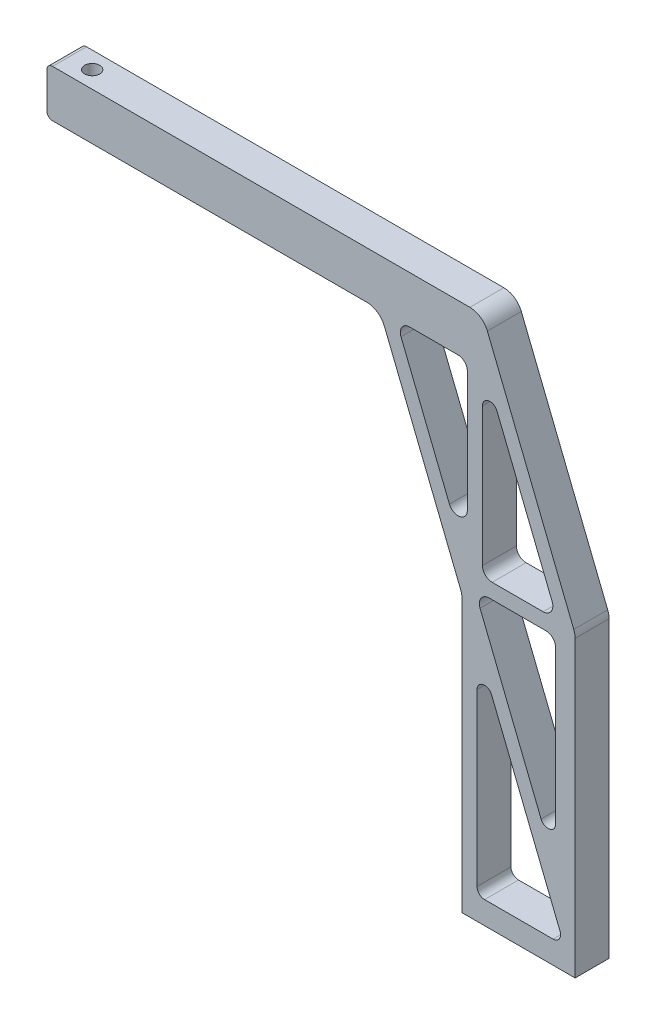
ISO-10303-21;
HEADER;
FILE_DESCRIPTION(('STEP AP214'),'2;1');
FILE_NAME('part.step','',(''),(''),'','','');
FILE_SCHEMA(('AUTOMOTIVE_DESIGN { 1 0 10303 214 1 1 1 1 }'));
ENDSEC;
DATA;
#1=APPLICATION_CONTEXT('core data for automotive mechanical design processes');
#2=APPLICATION_PROTOCOL_DEFINITION('international standard','automotive_design',2000,#1);
#3=PRODUCT_CONTEXT('',#1,'mechanical');
#4=PRODUCT('Part','Part','',(#3));
#5=PRODUCT_RELATED_PRODUCT_CATEGORY('part','',(#4));
#6=PRODUCT_DEFINITION_FORMATION('','',#4);
#7=PRODUCT_DEFINITION_CONTEXT('part definition',#1,'design');
#8=PRODUCT_DEFINITION('design','',#6,#7);
#9=PRODUCT_DEFINITION_SHAPE('','',#8);
#10=(LENGTH_UNIT() NAMED_UNIT(*) SI_UNIT(.MILLI.,.METRE.));
#11=(NAMED_UNIT(*) PLANE_ANGLE_UNIT() SI_UNIT($,.RADIAN.));
#12=(NAMED_UNIT(*) SI_UNIT($,.STERADIAN.) SOLID_ANGLE_UNIT());
#13=UNCERTAINTY_MEASURE_WITH_UNIT(LENGTH_MEASURE(1.E-05),#10,'distance_accuracy_value','');
#14=(GEOMETRIC_REPRESENTATION_CONTEXT(3) GLOBAL_UNCERTAINTY_ASSIGNED_CONTEXT((#13)) GLOBAL_UNIT_ASSIGNED_CONTEXT((#10,
#11,#12)) REPRESENTATION_CONTEXT('',''));
#15=CARTESIAN_POINT('',(0.,0.,0.));
#16=DIRECTION('',(0.,0.,1.));
#17=DIRECTION('',(1.,0.,0.));
#18=AXIS2_PLACEMENT_3D('',#15,#16,#17);
#19=CARTESIAN_POINT('',(50.,155.927840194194,18.));
#20=DIRECTION('',(0.,0.,1.));
#21=DIRECTION('',(1.,0.,0.));
#22=AXIS2_PLACEMENT_3D('',#19,#20,#21);
#23=PLANE('',#22);
#24=DIRECTION('',(0.,1.,0.));
#25=VECTOR('',#24,1.);
#26=CARTESIAN_POINT('',(49.6632497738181,65.4846192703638,18.));
#27=LINE('',#26,#25);
#28=CARTESIAN_POINT('',(49.6632497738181,65.4846192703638,18.));
#29=VERTEX_POINT('',#28);
#30=CARTESIAN_POINT('',(49.6632497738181,146.495883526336,18.));
#31=VERTEX_POINT('',#30);
#32=EDGE_CURVE('E352',#29,#31,#27,.T.);
#33=ORIENTED_EDGE('',*,*,#32,.F.);
#34=CARTESIAN_POINT('',(45.6632497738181,65.4846192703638,18.));
#35=DIRECTION('',(0.,0.,1.));
#36=DIRECTION('',(1.,0.,0.));
#37=AXIS2_PLACEMENT_3D('',#34,#35,#36);
#38=CIRCLE('',#37,4.);
#39=CARTESIAN_POINT('',(41.9512098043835,63.9943980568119,18.));
#40=VERTEX_POINT('',#39);
#41=EDGE_CURVE('E350',#40,#29,#38,.T.);
#42=ORIENTED_EDGE('',*,*,#41,.F.);
#43=DIRECTION('',(0.372555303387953,-0.928009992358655,0.));
#44=VECTOR('',#43,1.);
#45=CARTESIAN_POINT('',(9.60186337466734,144.574425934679,18.));
#46=LINE('',#45,#44);
#47=CARTESIAN_POINT('',(9.60186337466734,144.574425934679,18.));
#48=VERTEX_POINT('',#47);
#49=EDGE_CURVE('E365',#48,#40,#46,.T.);
#50=ORIENTED_EDGE('',*,*,#49,.F.);
#51=CARTESIAN_POINT('',(14.3880839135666,146.495883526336,18.));
#52=DIRECTION('',(0.,0.,1.));
#53=DIRECTION('',(1.,0.,0.));
#54=AXIS2_PLACEMENT_3D('',#51,#52,#53);
#55=CIRCLE('',#54,5.15750970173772);
#56=CARTESIAN_POINT('',(14.3880839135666,151.653393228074,18.));
#57=VERTEX_POINT('',#56);
#58=EDGE_CURVE('E362',#57,#48,#55,.T.);
#59=ORIENTED_EDGE('',*,*,#58,.F.);
#60=DIRECTION('',(-1.,0.,0.));
#61=VECTOR('',#60,1.);
#62=CARTESIAN_POINT('',(44.5057400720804,151.653393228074,18.));
#63=LINE('',#62,#61);
#64=CARTESIAN_POINT('',(44.5057400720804,151.653393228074,18.));
#65=VERTEX_POINT('',#64);
#66=EDGE_CURVE('E359',#65,#57,#63,.T.);
#67=ORIENTED_EDGE('',*,*,#66,.F.);
#68=CARTESIAN_POINT('',(44.5057400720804,146.495883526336,18.));
#69=DIRECTION('',(0.,0.,1.));
#70=DIRECTION('',(1.,0.,0.));
#71=AXIS2_PLACEMENT_3D('',#68,#69,#70);
#72=CIRCLE('',#71,5.15750970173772);
#73=EDGE_CURVE('E356',#31,#65,#72,.T.);
#74=ORIENTED_EDGE('',*,*,#73,.F.);
#75=EDGE_LOOP('',(#33,#42,#50,#59,#67,#74));
#76=FACE_BOUND('',#75,.T.);
#77=DIRECTION('',(1.,0.,0.));
#78=VECTOR('',#77,1.);
#79=CARTESIAN_POINT('',(48.2879600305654,12.,18.));
#80=LINE('',#79,#78);
#81=CARTESIAN_POINT('',(12.,12.,18.));
#82=VERTEX_POINT('',#81);
#83=CARTESIAN_POINT('',(48.2879600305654,12.,18.));
#84=VERTEX_POINT('',#83);
#85=EDGE_CURVE('E458',#82,#84,#80,.T.);
#86=ORIENTED_EDGE('',*,*,#85,.F.);
#87=CARTESIAN_POINT('',(12.,16.,18.));
#88=DIRECTION('',(0.,0.,1.));
#89=DIRECTION('',(1.,0.,0.));
#90=AXIS2_PLACEMENT_3D('',#87,#88,#89);
#91=CIRCLE('',#90,4.);
#92=CARTESIAN_POINT('',(8.00000000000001,16.,18.));
#93=VERTEX_POINT('',#92);
#94=EDGE_CURVE('E456',#93,#82,#91,.T.);
#95=ORIENTED_EDGE('',*,*,#94,.F.);
#96=DIRECTION('',(0.,-1.,0.));
#97=VECTOR('',#96,1.);
#98=CARTESIAN_POINT('',(8.00000000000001,16.,18.));
#99=LINE('',#98,#97);
#100=CARTESIAN_POINT('',(7.99999999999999,106.390847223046,18.));
#101=VERTEX_POINT('',#100);
#102=EDGE_CURVE('E468',#101,#93,#99,.T.);
#103=ORIENTED_EDGE('',*,*,#102,.F.);
#104=CARTESIAN_POINT('',(12.,106.390847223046,18.));
#105=DIRECTION('',(0.,0.,1.));
#106=DIRECTION('',(-1.,0.,0.));
#107=AXIS2_PLACEMENT_3D('',#104,#105,#106);
#108=CIRCLE('',#107,4.);
#109=CARTESIAN_POINT('',(15.7120399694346,107.881068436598,18.));
#110=VERTEX_POINT('',#109);
#111=EDGE_CURVE('E465',#110,#101,#108,.T.);
#112=ORIENTED_EDGE('',*,*,#111,.F.);
#113=DIRECTION('',(-0.372555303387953,0.928009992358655,0.));
#114=VECTOR('',#113,1.);
#115=CARTESIAN_POINT('',(15.7120399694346,107.881068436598,18.));
#116=LINE('',#115,#114);
#117=CARTESIAN_POINT('',(52.,17.4902212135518,18.));
#118=VERTEX_POINT('',#117);
#119=EDGE_CURVE('E463',#118,#110,#116,.T.);
#120=ORIENTED_EDGE('',*,*,#119,.F.);
#121=CARTESIAN_POINT('',(48.2879600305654,16.,18.));
#122=DIRECTION('',(0.,0.,1.));
#123=DIRECTION('',(-1.,0.,0.));
#124=AXIS2_PLACEMENT_3D('',#121,#122,#123);
#125=CIRCLE('',#124,4.);
#126=EDGE_CURVE('E461',#84,#118,#125,.T.);
#127=ORIENTED_EDGE('',*,*,#126,.F.);
#128=EDGE_LOOP('',(#86,#95,#103,#112,#120,#127));
#129=FACE_BOUND('',#128,.T.);
#130=DIRECTION('',(0.,-1.,0.));
#131=VECTOR('',#130,1.);
#132=CARTESIAN_POINT('',(0.,100.736428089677,18.));
#133=LINE('',#132,#131);
#134=CARTESIAN_POINT('',(0.,144.333855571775,18.));
#135=VERTEX_POINT('',#134);
#136=CARTESIAN_POINT('',(0.,0.,18.));
#137=VERTEX_POINT('',#136);
#138=EDGE_CURVE('E501',#135,#137,#133,.T.);
#139=ORIENTED_EDGE('',*,*,#138,.T.);
#140=DIRECTION('',(1.,0.,0.));
#141=VECTOR('',#140,1.);
#142=CARTESIAN_POINT('',(0.,0.,18.));
#143=LINE('',#142,#141);
#144=CARTESIAN_POINT('',(60.,0.,18.));
#145=VERTEX_POINT('',#144);
#146=EDGE_CURVE('E504',#137,#145,#143,.T.);
#147=ORIENTED_EDGE('',*,*,#146,.T.);
#148=DIRECTION('',(0.,1.,0.));
#149=VECTOR('',#148,1.);
#150=CARTESIAN_POINT('',(60.,0.,18.));
#151=LINE('',#150,#149);
#152=CARTESIAN_POINT('',(60.,155.927840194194,18.));
#153=VERTEX_POINT('',#152);
#154=EDGE_CURVE('E507',#145,#153,#151,.T.);
#155=ORIENTED_EDGE('',*,*,#154,.T.);
#156=CARTESIAN_POINT('',(50.,155.927840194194,18.));
#157=DIRECTION('',(0.,0.,1.));
#158=DIRECTION('',(1.,0.,0.));
#159=AXIS2_PLACEMENT_3D('',#156,#157,#158);
#160=CIRCLE('',#159,9.99999999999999);
#161=CARTESIAN_POINT('',(59.2800999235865,159.653393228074,18.));
#162=VERTEX_POINT('',#161);
#163=EDGE_CURVE('E510',#153,#162,#160,.T.);
#164=ORIENTED_EDGE('',*,*,#163,.T.);
#165=DIRECTION('',(-0.372555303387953,0.928009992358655,0.));
#166=VECTOR('',#165,1.);
#167=CARTESIAN_POINT('',(13.4851317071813,273.72555303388,18.));
#168=LINE('',#167,#166);
#169=CARTESIAN_POINT('',(13.4851317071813,273.72555303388,18.));
#170=VERTEX_POINT('',#169);
#171=EDGE_CURVE('E513',#162,#170,#168,.T.);
#172=ORIENTED_EDGE('',*,*,#171,.T.);
#173=CARTESIAN_POINT('',(4.20503178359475,270.,18.));
#174=DIRECTION('',(0.,0.,1.));
#175=DIRECTION('',(-1.,0.,0.));
#176=AXIS2_PLACEMENT_3D('',#173,#174,#175);
#177=CIRCLE('',#176,9.99999999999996);
#178=CARTESIAN_POINT('',(4.20503178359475,280.,18.));
#179=VERTEX_POINT('',#178);
#180=EDGE_CURVE('E516',#170,#179,#177,.T.);
#181=ORIENTED_EDGE('',*,*,#180,.T.);
#182=DIRECTION('',(-1.,0.,0.));
#183=VECTOR('',#182,1.);
#184=CARTESIAN_POINT('',(4.20503178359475,280.,18.));
#185=LINE('',#184,#183);
#186=CARTESIAN_POINT('',(-217.,280.,18.));
#187=VERTEX_POINT('',#186);
#188=EDGE_CURVE('E518',#179,#187,#185,.T.);
#189=ORIENTED_EDGE('',*,*,#188,.T.);
#190=CARTESIAN_POINT('',(-217.,277.,18.));
#191=DIRECTION('',(0.,0.,1.));
#192=DIRECTION('',(1.,0.,0.));
#193=AXIS2_PLACEMENT_3D('',#190,#191,#192);
#194=CIRCLE('',#193,3.);
#195=CARTESIAN_POINT('',(-220.,277.,18.));
#196=VERTEX_POINT('',#195);
#197=EDGE_CURVE('E520',#187,#196,#194,.T.);
#198=ORIENTED_EDGE('',*,*,#197,.T.);
#199=DIRECTION('',(0.,-1.,0.));
#200=VECTOR('',#199,1.);
#201=CARTESIAN_POINT('',(-220.,277.,18.));
#202=LINE('',#201,#200);
#203=CARTESIAN_POINT('',(-220.,258.,18.));
#204=VERTEX_POINT('',#203);
#205=EDGE_CURVE('E522',#196,#204,#202,.T.);
#206=ORIENTED_EDGE('',*,*,#205,.T.);
#207=CARTESIAN_POINT('',(-217.,258.,18.));
#208=DIRECTION('',(0.,0.,1.));
#209=DIRECTION('',(1.,0.,0.));
#210=AXIS2_PLACEMENT_3D('',#207,#208,#209);
#211=CIRCLE('',#210,3.);
#212=CARTESIAN_POINT('',(-217.,255.,18.));
#213=VERTEX_POINT('',#212);
#214=EDGE_CURVE('E524',#204,#213,#211,.T.);
#215=ORIENTED_EDGE('',*,*,#214,.T.);
#216=DIRECTION('',(1.,0.,0.));
#217=VECTOR('',#216,1.);
#218=CARTESIAN_POINT('',(-217.,255.,18.));
#219=LINE('',#218,#217);
#220=CARTESIAN_POINT('',(-50.4130411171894,255.,18.));
#221=VERTEX_POINT('',#220);
#222=EDGE_CURVE('E526',#213,#221,#219,.T.);
#223=ORIENTED_EDGE('',*,*,#222,.T.);
#224=CARTESIAN_POINT('',(-50.4130411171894,245.,18.));
#225=DIRECTION('',(0.,0.,-1.));
#226=DIRECTION('',(-1.,0.,0.));
#227=AXIS2_PLACEMENT_3D('',#224,#225,#226);
#228=CIRCLE('',#227,10.);
#229=CARTESIAN_POINT('',(-41.1329411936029,248.725553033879,18.));
#230=VERTEX_POINT('',#229);
#231=EDGE_CURVE('E528',#221,#230,#228,.T.);
#232=ORIENTED_EDGE('',*,*,#231,.T.);
#233=DIRECTION('',(0.372555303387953,-0.928009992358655,0.));
#234=VECTOR('',#233,1.);
#235=CARTESIAN_POINT('',(-41.1329411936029,248.725553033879,18.));
#236=LINE('',#235,#234);
#237=CARTESIAN_POINT('',(-0.719900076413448,148.059408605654,18.));
#238=VERTEX_POINT('',#237);
#239=EDGE_CURVE('E530',#230,#238,#236,.T.);
#240=ORIENTED_EDGE('',*,*,#239,.T.);
#241=CARTESIAN_POINT('',(-10.,144.333855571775,18.));
#242=DIRECTION('',(0.,0.,-1.));
#243=DIRECTION('',(1.,0.,0.));
#244=AXIS2_PLACEMENT_3D('',#241,#242,#243);
#245=CIRCLE('',#244,10.);
#246=EDGE_CURVE('E532',#238,#135,#245,.T.);
#247=ORIENTED_EDGE('',*,*,#246,.T.);
#248=EDGE_LOOP('',(#139,#147,#155,#164,#172,#181,#189,#198,#206,#215,#223,#232,#240,#247));
#249=FACE_BOUND('',#248,.T.);
#250=DIRECTION('',(0.,-1.,0.));
#251=VECTOR('',#250,1.);
#252=CARTESIAN_POINT('',(10.8557423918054,238.101471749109,18.));
#253=LINE('',#252,#251);
#254=CARTESIAN_POINT('',(10.8557423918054,238.101471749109,18.));
#255=VERTEX_POINT('',#254);
#256=CARTESIAN_POINT('',(10.8557423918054,164.810902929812,18.));
#257=VERTEX_POINT('',#256);
#258=EDGE_CURVE('E405',#255,#257,#253,.T.);
#259=ORIENTED_EDGE('',*,*,#258,.F.);
#260=CARTESIAN_POINT('',(14.8557423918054,238.101471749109,18.));
#261=DIRECTION('',(0.,0.,1.));
#262=DIRECTION('',(-1.,0.,0.));
#263=AXIS2_PLACEMENT_3D('',#260,#261,#262);
#264=CIRCLE('',#263,4.);
#265=CARTESIAN_POINT('',(18.5677823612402,239.591692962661,18.));
#266=VERTEX_POINT('',#265);
#267=EDGE_CURVE('E403',#266,#255,#264,.T.);
#268=ORIENTED_EDGE('',*,*,#267,.F.);
#269=DIRECTION('',(-0.372555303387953,0.928009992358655,0.));
#270=VECTOR('',#269,1.);
#271=CARTESIAN_POINT('',(47.8176082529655,166.732360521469,18.));
#272=LINE('',#271,#270);
#273=CARTESIAN_POINT('',(47.8176082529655,166.732360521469,18.));
#274=VERTEX_POINT('',#273);
#275=EDGE_CURVE('E417',#274,#266,#272,.T.);
#276=ORIENTED_EDGE('',*,*,#275,.F.);
#277=CARTESIAN_POINT('',(43.0313877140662,164.810902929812,18.));
#278=DIRECTION('',(0.,0.,1.));
#279=DIRECTION('',(1.,0.,0.));
#280=AXIS2_PLACEMENT_3D('',#277,#278,#279);
#281=CIRCLE('',#280,5.15750970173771);
#282=CARTESIAN_POINT('',(43.0313877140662,159.653393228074,18.));
#283=VERTEX_POINT('',#282);
#284=EDGE_CURVE('E413',#283,#274,#281,.T.);
#285=ORIENTED_EDGE('',*,*,#284,.F.);
#286=DIRECTION('',(1.,0.,0.));
#287=VECTOR('',#286,1.);
#288=CARTESIAN_POINT('',(16.0132520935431,159.653393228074,18.));
#289=LINE('',#288,#287);
#290=CARTESIAN_POINT('',(16.0132520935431,159.653393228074,18.));
#291=VERTEX_POINT('',#290);
#292=EDGE_CURVE('E410',#291,#283,#289,.T.);
#293=ORIENTED_EDGE('',*,*,#292,.F.);
#294=CARTESIAN_POINT('',(16.0132520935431,164.810902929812,18.));
#295=DIRECTION('',(0.,0.,1.));
#296=DIRECTION('',(1.,0.,0.));
#297=AXIS2_PLACEMENT_3D('',#294,#295,#296);
#298=CIRCLE('',#297,5.15750970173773);
#299=EDGE_CURVE('E408',#257,#291,#298,.T.);
#300=ORIENTED_EDGE('',*,*,#299,.F.);
#301=EDGE_LOOP('',(#259,#268,#276,#285,#293,#300));
#302=FACE_BOUND('',#301,.T.);
#303=DIRECTION('',(0.,1.,0.));
#304=VECTOR('',#303,1.);
#305=CARTESIAN_POINT('',(2.85574239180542,186.073407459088,18.));
#306=LINE('',#305,#304);
#307=CARTESIAN_POINT('',(2.85574239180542,186.073407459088,18.));
#308=VERTEX_POINT('',#307);
#309=CARTESIAN_POINT('',(2.85574239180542,250.082728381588,18.));
#310=VERTEX_POINT('',#309);
#311=EDGE_CURVE('E305',#308,#310,#306,.T.);
#312=ORIENTED_EDGE('',*,*,#311,.F.);
#313=CARTESIAN_POINT('',(-2.06152922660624,186.073407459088,18.));
#314=DIRECTION('',(0.,0.,1.));
#315=DIRECTION('',(-1.,0.,0.));
#316=AXIS2_PLACEMENT_3D('',#313,#314,#315);
#317=CIRCLE('',#316,4.91727161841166);
#318=CARTESIAN_POINT('',(-6.62480642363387,184.241451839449,18.));
#319=VERTEX_POINT('',#318);
#320=EDGE_CURVE('E297',#319,#308,#317,.T.);
#321=ORIENTED_EDGE('',*,*,#320,.F.);
#322=DIRECTION('',(0.372555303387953,-0.928009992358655,0.));
#323=VECTOR('',#322,1.);
#324=CARTESIAN_POINT('',(-32.321740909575,248.25077276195,18.));
#325=LINE('',#324,#323);
#326=CARTESIAN_POINT('',(-32.321740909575,248.25077276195,18.));
#327=VERTEX_POINT('',#326);
#328=EDGE_CURVE('E327',#327,#319,#325,.T.);
#329=ORIENTED_EDGE('',*,*,#328,.F.);
#330=CARTESIAN_POINT('',(-27.7584637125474,250.082728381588,18.));
#331=DIRECTION('',(0.,0.,1.));
#332=DIRECTION('',(1.,0.,0.));
#333=AXIS2_PLACEMENT_3D('',#330,#331,#332);
#334=CIRCLE('',#333,4.91727161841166);
#335=CARTESIAN_POINT('',(-27.7584637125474,255.,18.));
#336=VERTEX_POINT('',#335);
#337=EDGE_CURVE('E325',#336,#327,#334,.T.);
#338=ORIENTED_EDGE('',*,*,#337,.F.);
#339=DIRECTION('',(-1.,0.,0.));
#340=VECTOR('',#339,1.);
#341=CARTESIAN_POINT('',(-27.7584637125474,255.,18.));
#342=LINE('',#341,#340);
#343=CARTESIAN_POINT('',(-2.06152922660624,255.,18.));
#344=VERTEX_POINT('',#343);
#345=EDGE_CURVE('E320',#344,#336,#342,.T.);
#346=ORIENTED_EDGE('',*,*,#345,.F.);
#347=CARTESIAN_POINT('',(-2.06152922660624,250.082728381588,18.));
#348=DIRECTION('',(0.,0.,1.));
#349=DIRECTION('',(1.,0.,0.));
#350=AXIS2_PLACEMENT_3D('',#347,#348,#349);
#351=CIRCLE('',#350,4.91727161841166);
#352=EDGE_CURVE('E318',#310,#344,#351,.T.);
#353=ORIENTED_EDGE('',*,*,#352,.F.);
#354=EDGE_LOOP('',(#312,#321,#329,#338,#346,#353));
#355=FACE_BOUND('',#354,.T.);
#356=ADVANCED_FACE('F40',(#76,#129,#249,#302,#355),#23,.T.);
#357=CARTESIAN_POINT('',(50.,155.927840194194,0.));
#358=DIRECTION('',(0.,0.,1.));
#359=DIRECTION('',(1.,0.,0.));
#360=AXIS2_PLACEMENT_3D('',#357,#358,#359);
#361=PLANE('',#360);
#362=CARTESIAN_POINT('',(45.6632497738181,65.4846192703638,0.));
#363=DIRECTION('',(0.,0.,1.));
#364=DIRECTION('',(1.,0.,0.));
#365=AXIS2_PLACEMENT_3D('',#362,#363,#364);
#366=CIRCLE('',#365,4.);
#367=CARTESIAN_POINT('',(41.9512098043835,63.9943980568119,0.));
#368=VERTEX_POINT('',#367);
#369=CARTESIAN_POINT('',(49.6632497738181,65.4846192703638,0.));
#370=VERTEX_POINT('',#369);
#371=EDGE_CURVE('E313',#368,#370,#366,.T.);
#372=ORIENTED_EDGE('',*,*,#371,.T.);
#373=DIRECTION('',(0.,1.,0.));
#374=VECTOR('',#373,1.);
#375=CARTESIAN_POINT('',(49.6632497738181,65.4846192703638,0.));
#376=LINE('',#375,#374);
#377=CARTESIAN_POINT('',(49.6632497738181,146.495883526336,0.));
#378=VERTEX_POINT('',#377);
#379=EDGE_CURVE('E370',#370,#378,#376,.T.);
#380=ORIENTED_EDGE('',*,*,#379,.T.);
#381=CARTESIAN_POINT('',(44.5057400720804,146.495883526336,0.));
#382=DIRECTION('',(0.,0.,1.));
#383=DIRECTION('',(1.,0.,0.));
#384=AXIS2_PLACEMENT_3D('',#381,#382,#383);
#385=CIRCLE('',#384,5.15750970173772);
#386=CARTESIAN_POINT('',(44.5057400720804,151.653393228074,0.));
#387=VERTEX_POINT('',#386);
#388=EDGE_CURVE('E374',#378,#387,#385,.T.);
#389=ORIENTED_EDGE('',*,*,#388,.T.);
#390=DIRECTION('',(-1.,0.,0.));
#391=VECTOR('',#390,1.);
#392=CARTESIAN_POINT('',(44.5057400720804,151.653393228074,0.));
#393=LINE('',#392,#391);
#394=CARTESIAN_POINT('',(14.3880839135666,151.653393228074,0.));
#395=VERTEX_POINT('',#394);
#396=EDGE_CURVE('E378',#387,#395,#393,.T.);
#397=ORIENTED_EDGE('',*,*,#396,.T.);
#398=CARTESIAN_POINT('',(14.3880839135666,146.495883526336,0.));
#399=DIRECTION('',(0.,0.,1.));
#400=DIRECTION('',(1.,0.,0.));
#401=AXIS2_PLACEMENT_3D('',#398,#399,#400);
#402=CIRCLE('',#401,5.15750970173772);
#403=CARTESIAN_POINT('',(9.60186337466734,144.574425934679,0.));
#404=VERTEX_POINT('',#403);
#405=EDGE_CURVE('E382',#395,#404,#402,.T.);
#406=ORIENTED_EDGE('',*,*,#405,.T.);
#407=DIRECTION('',(0.372555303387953,-0.928009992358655,0.));
#408=VECTOR('',#407,1.);
#409=CARTESIAN_POINT('',(9.60186337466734,144.574425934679,0.));
#410=LINE('',#409,#408);
#411=EDGE_CURVE('E353',#404,#368,#410,.T.);
#412=ORIENTED_EDGE('',*,*,#411,.T.);
#413=EDGE_LOOP('',(#372,#380,#389,#397,#406,#412));
#414=FACE_BOUND('',#413,.T.);
#415=CARTESIAN_POINT('',(12.,16.,0.));
#416=DIRECTION('',(0.,0.,1.));
#417=DIRECTION('',(1.,0.,0.));
#418=AXIS2_PLACEMENT_3D('',#415,#416,#417);
#419=CIRCLE('',#418,4.);
#420=CARTESIAN_POINT('',(8.00000000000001,16.,0.));
#421=VERTEX_POINT('',#420);
#422=CARTESIAN_POINT('',(12.,12.,0.));
#423=VERTEX_POINT('',#422);
#424=EDGE_CURVE('E455',#421,#423,#419,.T.);
#425=ORIENTED_EDGE('',*,*,#424,.T.);
#426=DIRECTION('',(1.,0.,0.));
#427=VECTOR('',#426,1.);
#428=CARTESIAN_POINT('',(48.2879600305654,12.,0.));
#429=LINE('',#428,#427);
#430=CARTESIAN_POINT('',(48.2879600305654,12.,0.));
#431=VERTEX_POINT('',#430);
#432=EDGE_CURVE('E473',#423,#431,#429,.T.);
#433=ORIENTED_EDGE('',*,*,#432,.T.);
#434=CARTESIAN_POINT('',(48.2879600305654,16.,0.));
#435=DIRECTION('',(0.,0.,1.));
#436=DIRECTION('',(-1.,0.,0.));
#437=AXIS2_PLACEMENT_3D('',#434,#435,#436);
#438=CIRCLE('',#437,4.);
#439=CARTESIAN_POINT('',(52.,17.4902212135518,0.));
#440=VERTEX_POINT('',#439);
#441=EDGE_CURVE('E476',#431,#440,#438,.T.);
#442=ORIENTED_EDGE('',*,*,#441,.T.);
#443=DIRECTION('',(-0.372555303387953,0.928009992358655,0.));
#444=VECTOR('',#443,1.);
#445=CARTESIAN_POINT('',(15.7120399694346,107.881068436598,0.));
#446=LINE('',#445,#444);
#447=CARTESIAN_POINT('',(15.7120399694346,107.881068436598,0.));
#448=VERTEX_POINT('',#447);
#449=EDGE_CURVE('E479',#440,#448,#446,.T.);
#450=ORIENTED_EDGE('',*,*,#449,.T.);
#451=CARTESIAN_POINT('',(12.,106.390847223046,0.));
#452=DIRECTION('',(0.,0.,1.));
#453=DIRECTION('',(-1.,0.,0.));
#454=AXIS2_PLACEMENT_3D('',#451,#452,#453);
#455=CIRCLE('',#454,4.);
#456=CARTESIAN_POINT('',(7.99999999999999,106.390847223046,0.));
#457=VERTEX_POINT('',#456);
#458=EDGE_CURVE('E482',#448,#457,#455,.T.);
#459=ORIENTED_EDGE('',*,*,#458,.T.);
#460=DIRECTION('',(0.,-1.,0.));
#461=VECTOR('',#460,1.);
#462=CARTESIAN_POINT('',(8.00000000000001,16.,0.));
#463=LINE('',#462,#461);
#464=EDGE_CURVE('E459',#457,#421,#463,.T.);
#465=ORIENTED_EDGE('',*,*,#464,.T.);
#466=EDGE_LOOP('',(#425,#433,#442,#450,#459,#465));
#467=FACE_BOUND('',#466,.T.);
#468=DIRECTION('',(1.,0.,0.));
#469=VECTOR('',#468,1.);
#470=CARTESIAN_POINT('',(0.,0.,0.));
#471=LINE('',#470,#469);
#472=CARTESIAN_POINT('',(0.,0.,0.));
#473=VERTEX_POINT('',#472);
#474=CARTESIAN_POINT('',(60.,0.,0.));
#475=VERTEX_POINT('',#474);
#476=EDGE_CURVE('E500',#473,#475,#471,.T.);
#477=ORIENTED_EDGE('',*,*,#476,.F.);
#478=DIRECTION('',(0.,-1.,0.));
#479=VECTOR('',#478,1.);
#480=CARTESIAN_POINT('',(0.,144.333855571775,0.));
#481=LINE('',#480,#479);
#482=CARTESIAN_POINT('',(0.,144.333855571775,0.));
#483=VERTEX_POINT('',#482);
#484=EDGE_CURVE('E505',#483,#473,#481,.T.);
#485=ORIENTED_EDGE('',*,*,#484,.F.);
#486=CARTESIAN_POINT('',(-10.,144.333855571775,0.));
#487=DIRECTION('',(0.,0.,-1.));
#488=DIRECTION('',(1.,0.,0.));
#489=AXIS2_PLACEMENT_3D('',#486,#487,#488);
#490=CIRCLE('',#489,10.);
#491=CARTESIAN_POINT('',(-0.719900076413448,148.059408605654,0.));
#492=VERTEX_POINT('',#491);
#493=EDGE_CURVE('E562',#492,#483,#490,.T.);
#494=ORIENTED_EDGE('',*,*,#493,.F.);
#495=DIRECTION('',(0.372555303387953,-0.928009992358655,0.));
#496=VECTOR('',#495,1.);
#497=CARTESIAN_POINT('',(-41.1329411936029,248.725553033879,0.));
#498=LINE('',#497,#496);
#499=CARTESIAN_POINT('',(-41.1329411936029,248.725553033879,0.));
#500=VERTEX_POINT('',#499);
#501=EDGE_CURVE('E560',#500,#492,#498,.T.);
#502=ORIENTED_EDGE('',*,*,#501,.F.);
#503=CARTESIAN_POINT('',(-50.4130411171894,245.,0.));
#504=DIRECTION('',(0.,0.,-1.));
#505=DIRECTION('',(-1.,0.,0.));
#506=AXIS2_PLACEMENT_3D('',#503,#504,#505);
#507=CIRCLE('',#506,10.);
#508=CARTESIAN_POINT('',(-50.4130411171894,255.,0.));
#509=VERTEX_POINT('',#508);
#510=EDGE_CURVE('E558',#509,#500,#507,.T.);
#511=ORIENTED_EDGE('',*,*,#510,.F.);
#512=DIRECTION('',(1.,0.,0.));
#513=VECTOR('',#512,1.);
#514=CARTESIAN_POINT('',(-217.,255.,0.));
#515=LINE('',#514,#513);
#516=CARTESIAN_POINT('',(-217.,255.,0.));
#517=VERTEX_POINT('',#516);
#518=EDGE_CURVE('E556',#517,#509,#515,.T.);
#519=ORIENTED_EDGE('',*,*,#518,.F.);
#520=CARTESIAN_POINT('',(-217.,258.,0.));
#521=DIRECTION('',(0.,0.,1.));
#522=DIRECTION('',(1.,0.,0.));
#523=AXIS2_PLACEMENT_3D('',#520,#521,#522);
#524=CIRCLE('',#523,3.);
#525=CARTESIAN_POINT('',(-220.,258.,0.));
#526=VERTEX_POINT('',#525);
#527=EDGE_CURVE('E554',#526,#517,#524,.T.);
#528=ORIENTED_EDGE('',*,*,#527,.F.);
#529=DIRECTION('',(0.,-1.,0.));
#530=VECTOR('',#529,1.);
#531=CARTESIAN_POINT('',(-220.,277.,0.));
#532=LINE('',#531,#530);
#533=CARTESIAN_POINT('',(-220.,277.,0.));
#534=VERTEX_POINT('',#533);
#535=EDGE_CURVE('E552',#534,#526,#532,.T.);
#536=ORIENTED_EDGE('',*,*,#535,.F.);
#537=CARTESIAN_POINT('',(-217.,277.,0.));
#538=DIRECTION('',(0.,0.,1.));
#539=DIRECTION('',(1.,0.,0.));
#540=AXIS2_PLACEMENT_3D('',#537,#538,#539);
#541=CIRCLE('',#540,3.);
#542=CARTESIAN_POINT('',(-217.,280.,0.));
#543=VERTEX_POINT('',#542);
#544=EDGE_CURVE('E550',#543,#534,#541,.T.);
#545=ORIENTED_EDGE('',*,*,#544,.F.);
#546=DIRECTION('',(-1.,0.,0.));
#547=VECTOR('',#546,1.);
#548=CARTESIAN_POINT('',(4.20503178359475,280.,0.));
#549=LINE('',#548,#547);
#550=CARTESIAN_POINT('',(4.20503178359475,280.,0.));
#551=VERTEX_POINT('',#550);
#552=EDGE_CURVE('E548',#551,#543,#549,.T.);
#553=ORIENTED_EDGE('',*,*,#552,.F.);
#554=CARTESIAN_POINT('',(4.20503178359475,270.,0.));
#555=DIRECTION('',(0.,0.,1.));
#556=DIRECTION('',(-1.,0.,0.));
#557=AXIS2_PLACEMENT_3D('',#554,#555,#556);
#558=CIRCLE('',#557,9.99999999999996);
#559=CARTESIAN_POINT('',(13.4851317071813,273.72555303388,0.));
#560=VERTEX_POINT('',#559);
#561=EDGE_CURVE('E546',#560,#551,#558,.T.);
#562=ORIENTED_EDGE('',*,*,#561,.F.);
#563=DIRECTION('',(-0.372555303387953,0.928009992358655,0.));
#564=VECTOR('',#563,1.);
#565=CARTESIAN_POINT('',(13.4851317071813,273.72555303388,0.));
#566=LINE('',#565,#564);
#567=CARTESIAN_POINT('',(59.2800999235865,159.653393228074,0.));
#568=VERTEX_POINT('',#567);
#569=EDGE_CURVE('E543',#568,#560,#566,.T.);
#570=ORIENTED_EDGE('',*,*,#569,.F.);
#571=CARTESIAN_POINT('',(50.,155.927840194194,0.));
#572=DIRECTION('',(0.,0.,1.));
#573=DIRECTION('',(1.,0.,0.));
#574=AXIS2_PLACEMENT_3D('',#571,#572,#573);
#575=CIRCLE('',#574,9.99999999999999);
#576=CARTESIAN_POINT('',(60.,155.927840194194,0.));
#577=VERTEX_POINT('',#576);
#578=EDGE_CURVE('E540',#577,#568,#575,.T.);
#579=ORIENTED_EDGE('',*,*,#578,.F.);
#580=DIRECTION('',(0.,1.,0.));
#581=VECTOR('',#580,1.);
#582=CARTESIAN_POINT('',(60.,0.,0.));
#583=LINE('',#582,#581);
#584=EDGE_CURVE('E537',#475,#577,#583,.T.);
#585=ORIENTED_EDGE('',*,*,#584,.F.);
#586=EDGE_LOOP('',(#477,#485,#494,#502,#511,#519,#528,#536,#545,#553,#562,#570,#579,#585));
#587=FACE_BOUND('',#586,.T.);
#588=CARTESIAN_POINT('',(14.8557423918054,238.101471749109,0.));
#589=DIRECTION('',(0.,0.,1.));
#590=DIRECTION('',(-1.,0.,0.));
#591=AXIS2_PLACEMENT_3D('',#588,#589,#590);
#592=CIRCLE('',#591,4.);
#593=CARTESIAN_POINT('',(18.5677823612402,239.591692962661,0.));
#594=VERTEX_POINT('',#593);
#595=CARTESIAN_POINT('',(10.8557423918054,238.101471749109,0.));
#596=VERTEX_POINT('',#595);
#597=EDGE_CURVE('E402',#594,#596,#592,.T.);
#598=ORIENTED_EDGE('',*,*,#597,.T.);
#599=DIRECTION('',(0.,-1.,0.));
#600=VECTOR('',#599,1.);
#601=CARTESIAN_POINT('',(10.8557423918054,238.101471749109,0.));
#602=LINE('',#601,#600);
#603=CARTESIAN_POINT('',(10.8557423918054,164.810902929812,0.));
#604=VERTEX_POINT('',#603);
#605=EDGE_CURVE('E423',#596,#604,#602,.T.);
#606=ORIENTED_EDGE('',*,*,#605,.T.);
#607=CARTESIAN_POINT('',(16.0132520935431,164.810902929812,0.));
#608=DIRECTION('',(0.,0.,1.));
#609=DIRECTION('',(1.,0.,0.));
#610=AXIS2_PLACEMENT_3D('',#607,#608,#609);
#611=CIRCLE('',#610,5.15750970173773);
#612=CARTESIAN_POINT('',(16.0132520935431,159.653393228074,0.));
#613=VERTEX_POINT('',#612);
#614=EDGE_CURVE('E426',#604,#613,#611,.T.);
#615=ORIENTED_EDGE('',*,*,#614,.T.);
#616=DIRECTION('',(1.,0.,0.));
#617=VECTOR('',#616,1.);
#618=CARTESIAN_POINT('',(16.0132520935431,159.653393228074,0.));
#619=LINE('',#618,#617);
#620=CARTESIAN_POINT('',(43.0313877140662,159.653393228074,0.));
#621=VERTEX_POINT('',#620);
#622=EDGE_CURVE('E429',#613,#621,#619,.T.);
#623=ORIENTED_EDGE('',*,*,#622,.T.);
#624=CARTESIAN_POINT('',(43.0313877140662,164.810902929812,0.));
#625=DIRECTION('',(0.,0.,1.));
#626=DIRECTION('',(1.,0.,0.));
#627=AXIS2_PLACEMENT_3D('',#624,#625,#626);
#628=CIRCLE('',#627,5.15750970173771);
#629=CARTESIAN_POINT('',(47.8176082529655,166.732360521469,0.));
#630=VERTEX_POINT('',#629);
#631=EDGE_CURVE('E433',#621,#630,#628,.T.);
#632=ORIENTED_EDGE('',*,*,#631,.T.);
#633=DIRECTION('',(-0.372555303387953,0.928009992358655,0.));
#634=VECTOR('',#633,1.);
#635=CARTESIAN_POINT('',(47.8176082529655,166.732360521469,0.));
#636=LINE('',#635,#634);
#637=EDGE_CURVE('E406',#630,#594,#636,.T.);
#638=ORIENTED_EDGE('',*,*,#637,.T.);
#639=EDGE_LOOP('',(#598,#606,#615,#623,#632,#638));
#640=FACE_BOUND('',#639,.T.);
#641=CARTESIAN_POINT('',(-2.06152922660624,186.073407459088,0.));
#642=DIRECTION('',(0.,0.,1.));
#643=DIRECTION('',(-1.,0.,0.));
#644=AXIS2_PLACEMENT_3D('',#641,#642,#643);
#645=CIRCLE('',#644,4.91727161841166);
#646=CARTESIAN_POINT('',(-6.62480642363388,184.241451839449,0.));
#647=VERTEX_POINT('',#646);
#648=CARTESIAN_POINT('',(2.85574239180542,186.073407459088,0.));
#649=VERTEX_POINT('',#648);
#650=EDGE_CURVE('E63',#647,#649,#645,.T.);
#651=ORIENTED_EDGE('',*,*,#650,.T.);
#652=DIRECTION('',(0.,1.,0.));
#653=VECTOR('',#652,1.);
#654=CARTESIAN_POINT('',(2.85574239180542,186.073407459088,0.));
#655=LINE('',#654,#653);
#656=CARTESIAN_POINT('',(2.85574239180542,250.082728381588,0.));
#657=VERTEX_POINT('',#656);
#658=EDGE_CURVE('E312',#649,#657,#655,.T.);
#659=ORIENTED_EDGE('',*,*,#658,.T.);
#660=CARTESIAN_POINT('',(-2.06152922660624,250.082728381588,0.));
#661=DIRECTION('',(0.,0.,1.));
#662=DIRECTION('',(1.,0.,0.));
#663=AXIS2_PLACEMENT_3D('',#660,#661,#662);
#664=CIRCLE('',#663,4.91727161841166);
#665=CARTESIAN_POINT('',(-2.06152922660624,255.,0.));
#666=VERTEX_POINT('',#665);
#667=EDGE_CURVE('E332',#657,#666,#664,.T.);
#668=ORIENTED_EDGE('',*,*,#667,.T.);
#669=DIRECTION('',(-1.,0.,0.));
#670=VECTOR('',#669,1.);
#671=CARTESIAN_POINT('',(-27.7584637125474,255.,0.));
#672=LINE('',#671,#670);
#673=CARTESIAN_POINT('',(-27.7584637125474,255.,0.));
#674=VERTEX_POINT('',#673);
#675=EDGE_CURVE('E335',#666,#674,#672,.T.);
#676=ORIENTED_EDGE('',*,*,#675,.T.);
#677=CARTESIAN_POINT('',(-27.7584637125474,250.082728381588,0.));
#678=DIRECTION('',(0.,0.,1.));
#679=DIRECTION('',(1.,0.,0.));
#680=AXIS2_PLACEMENT_3D('',#677,#678,#679);
#681=CIRCLE('',#680,4.91727161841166);
#682=CARTESIAN_POINT('',(-32.321740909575,248.25077276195,0.));
#683=VERTEX_POINT('',#682);
#684=EDGE_CURVE('E338',#674,#683,#681,.T.);
#685=ORIENTED_EDGE('',*,*,#684,.T.);
#686=DIRECTION('',(0.372555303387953,-0.928009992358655,0.));
#687=VECTOR('',#686,1.);
#688=CARTESIAN_POINT('',(-32.321740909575,248.25077276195,0.));
#689=LINE('',#688,#687);
#690=EDGE_CURVE('E306',#683,#647,#689,.T.);
#691=ORIENTED_EDGE('',*,*,#690,.T.);
#692=EDGE_LOOP('',(#651,#659,#668,#676,#685,#691));
#693=FACE_BOUND('',#692,.T.);
#694=ADVANCED_FACE('F612',(#414,#467,#587,#640,#693),#361,.F.);
#695=CARTESIAN_POINT('',(0.,0.,18.));
#696=DIRECTION('',(0.,1.,0.));
#697=DIRECTION('',(0.,0.,1.));
#698=AXIS2_PLACEMENT_3D('',#695,#696,#697);
#699=PLANE('',#698);
#700=ORIENTED_EDGE('',*,*,#476,.T.);
#701=DIRECTION('',(0.,0.,-1.));
#702=VECTOR('',#701,1.);
#703=CARTESIAN_POINT('',(60.,0.,18.));
#704=LINE('',#703,#702);
#705=EDGE_CURVE('E48',#145,#475,#704,.T.);
#706=ORIENTED_EDGE('',*,*,#705,.F.);
#707=ORIENTED_EDGE('',*,*,#146,.F.);
#708=DIRECTION('',(0.,0.,-1.));
#709=VECTOR('',#708,1.);
#710=CARTESIAN_POINT('',(0.,0.,18.));
#711=LINE('',#710,#709);
#712=EDGE_CURVE('E12',#137,#473,#711,.T.);
#713=ORIENTED_EDGE('',*,*,#712,.T.);
#714=EDGE_LOOP('',(#700,#706,#707,#713));
#715=FACE_BOUND('',#714,.T.);
#716=ADVANCED_FACE('F42',(#715),#699,.F.);
#717=CARTESIAN_POINT('',(60.,0.,18.));
#718=DIRECTION('',(-1.,0.,0.));
#719=DIRECTION('',(0.,-1.,0.));
#720=AXIS2_PLACEMENT_3D('',#717,#718,#719);
#721=PLANE('',#720);
#722=ORIENTED_EDGE('',*,*,#584,.T.);
#723=DIRECTION('',(0.,0.,-1.));
#724=VECTOR('',#723,1.);
#725=CARTESIAN_POINT('',(60.,155.927840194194,18.));
#726=LINE('',#725,#724);
#727=EDGE_CURVE('E598',#153,#577,#726,.T.);
#728=ORIENTED_EDGE('',*,*,#727,.F.);
#729=ORIENTED_EDGE('',*,*,#154,.F.);
#730=ORIENTED_EDGE('',*,*,#705,.T.);
#731=EDGE_LOOP('',(#722,#728,#729,#730));
#732=FACE_BOUND('',#731,.T.);
#733=ADVANCED_FACE('F606',(#732),#721,.F.);
#734=CARTESIAN_POINT('',(50.,155.927840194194,18.));
#735=DIRECTION('',(0.,0.,-1.));
#736=DIRECTION('',(-1.,0.,0.));
#737=AXIS2_PLACEMENT_3D('',#734,#735,#736);
#738=CYLINDRICAL_SURFACE('',#737,9.99999999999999);
#739=ORIENTED_EDGE('',*,*,#578,.T.);
#740=DIRECTION('',(0.,0.,-1.));
#741=VECTOR('',#740,1.);
#742=CARTESIAN_POINT('',(59.2800999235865,159.653393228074,18.));
#743=LINE('',#742,#741);
#744=EDGE_CURVE('E594',#162,#568,#743,.T.);
#745=ORIENTED_EDGE('',*,*,#744,.F.);
#746=ORIENTED_EDGE('',*,*,#163,.F.);
#747=ORIENTED_EDGE('',*,*,#727,.T.);
#748=EDGE_LOOP('',(#739,#745,#746,#747));
#749=FACE_BOUND('',#748,.T.);
#750=ADVANCED_FACE('F619',(#749),#738,.T.);
#751=CARTESIAN_POINT('',(13.4851317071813,273.72555303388,18.));
#752=DIRECTION('',(-0.928009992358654,-0.372555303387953,0.));
#753=DIRECTION('',(0.372555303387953,-0.928009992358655,0.));
#754=AXIS2_PLACEMENT_3D('',#751,#752,#753);
#755=PLANE('',#754);
#756=ORIENTED_EDGE('',*,*,#569,.T.);
#757=DIRECTION('',(0.,0.,-1.));
#758=VECTOR('',#757,1.);
#759=CARTESIAN_POINT('',(13.4851317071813,273.72555303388,18.));
#760=LINE('',#759,#758);
#761=EDGE_CURVE('E591',#170,#560,#760,.T.);
#762=ORIENTED_EDGE('',*,*,#761,.F.);
#763=ORIENTED_EDGE('',*,*,#171,.F.);
#764=ORIENTED_EDGE('',*,*,#744,.T.);
#765=EDGE_LOOP('',(#756,#762,#763,#764));
#766=FACE_BOUND('',#765,.T.);
#767=ADVANCED_FACE('F623',(#766),#755,.F.);
#768=CARTESIAN_POINT('',(4.20503178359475,270.,18.));
#769=DIRECTION('',(0.,0.,-1.));
#770=DIRECTION('',(-1.,0.,0.));
#771=AXIS2_PLACEMENT_3D('',#768,#769,#770);
#772=CYLINDRICAL_SURFACE('',#771,9.99999999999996);
#773=ORIENTED_EDGE('',*,*,#561,.T.);
#774=DIRECTION('',(0.,0.,-1.));
#775=VECTOR('',#774,1.);
#776=CARTESIAN_POINT('',(4.20503178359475,280.,18.));
#777=LINE('',#776,#775);
#778=EDGE_CURVE('E588',#179,#551,#777,.T.);
#779=ORIENTED_EDGE('',*,*,#778,.F.);
#780=ORIENTED_EDGE('',*,*,#180,.F.);
#781=ORIENTED_EDGE('',*,*,#761,.T.);
#782=EDGE_LOOP('',(#773,#779,#780,#781));
#783=FACE_BOUND('',#782,.T.);
#784=ADVANCED_FACE('F673',(#783),#772,.T.);
#785=CARTESIAN_POINT('',(4.20503178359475,280.,18.));
#786=DIRECTION('',(0.,-1.,0.));
#787=DIRECTION('',(1.,0.,0.));
#788=AXIS2_PLACEMENT_3D('',#785,#786,#787);
#789=PLANE('',#788);
#790=CARTESIAN_POINT('',(-205.,280.,9.));
#791=DIRECTION('',(0.,1.,0.));
#792=DIRECTION('',(-1.,0.,0.));
#793=AXIS2_PLACEMENT_3D('',#790,#791,#792);
#794=CIRCLE('',#793,3.99999999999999);
#795=CARTESIAN_POINT('',(-209.,280.,9.));
#796=VERTEX_POINT('',#795);
#797=EDGE_CURVE('E1059',#796,#796,#794,.T.);
#798=ORIENTED_EDGE('',*,*,#797,.F.);
#799=EDGE_LOOP('',(#798));
#800=FACE_BOUND('',#799,.T.);
#801=ORIENTED_EDGE('',*,*,#552,.T.);
#802=DIRECTION('',(0.,0.,-1.));
#803=VECTOR('',#802,1.);
#804=CARTESIAN_POINT('',(-217.,280.,18.));
#805=LINE('',#804,#803);
#806=EDGE_CURVE('E585',#187,#543,#805,.T.);
#807=ORIENTED_EDGE('',*,*,#806,.F.);
#808=ORIENTED_EDGE('',*,*,#188,.F.);
#809=ORIENTED_EDGE('',*,*,#778,.T.);
#810=EDGE_LOOP('',(#801,#807,#808,#809));
#811=FACE_BOUND('',#810,.T.);
#812=ADVANCED_FACE('F671',(#800,#811),#789,.F.);
#813=CARTESIAN_POINT('',(-217.,277.,18.));
#814=DIRECTION('',(0.,0.,-1.));
#815=DIRECTION('',(-1.,0.,0.));
#816=AXIS2_PLACEMENT_3D('',#813,#814,#815);
#817=CYLINDRICAL_SURFACE('',#816,3.);
#818=ORIENTED_EDGE('',*,*,#544,.T.);
#819=DIRECTION('',(0.,0.,-1.));
#820=VECTOR('',#819,1.);
#821=CARTESIAN_POINT('',(-220.,277.,18.));
#822=LINE('',#821,#820);
#823=EDGE_CURVE('E582',#196,#534,#822,.T.);
#824=ORIENTED_EDGE('',*,*,#823,.F.);
#825=ORIENTED_EDGE('',*,*,#197,.F.);
#826=ORIENTED_EDGE('',*,*,#806,.T.);
#827=EDGE_LOOP('',(#818,#824,#825,#826));
#828=FACE_BOUND('',#827,.T.);
#829=ADVANCED_FACE('F666',(#828),#817,.T.);
#830=CARTESIAN_POINT('',(-220.,277.,18.));
#831=DIRECTION('',(1.,0.,0.));
#832=DIRECTION('',(0.,1.,0.));
#833=AXIS2_PLACEMENT_3D('',#830,#831,#832);
#834=PLANE('',#833);
#835=ORIENTED_EDGE('',*,*,#535,.T.);
#836=DIRECTION('',(0.,0.,-1.));
#837=VECTOR('',#836,1.);
#838=CARTESIAN_POINT('',(-220.,258.,18.));
#839=LINE('',#838,#837);
#840=EDGE_CURVE('E579',#204,#526,#839,.T.);
#841=ORIENTED_EDGE('',*,*,#840,.F.);
#842=ORIENTED_EDGE('',*,*,#205,.F.);
#843=ORIENTED_EDGE('',*,*,#823,.T.);
#844=EDGE_LOOP('',(#835,#841,#842,#843));
#845=FACE_BOUND('',#844,.T.);
#846=ADVANCED_FACE('F661',(#845),#834,.F.);
#847=CARTESIAN_POINT('',(-217.,258.,18.));
#848=DIRECTION('',(0.,0.,-1.));
#849=DIRECTION('',(-1.,0.,0.));
#850=AXIS2_PLACEMENT_3D('',#847,#848,#849);
#851=CYLINDRICAL_SURFACE('',#850,3.);
#852=ORIENTED_EDGE('',*,*,#527,.T.);
#853=DIRECTION('',(0.,0.,-1.));
#854=VECTOR('',#853,1.);
#855=CARTESIAN_POINT('',(-217.,255.,18.));
#856=LINE('',#855,#854);
#857=EDGE_CURVE('E576',#213,#517,#856,.T.);
#858=ORIENTED_EDGE('',*,*,#857,.F.);
#859=ORIENTED_EDGE('',*,*,#214,.F.);
#860=ORIENTED_EDGE('',*,*,#840,.T.);
#861=EDGE_LOOP('',(#852,#858,#859,#860));
#862=FACE_BOUND('',#861,.T.);
#863=ADVANCED_FACE('F657',(#862),#851,.T.);
#864=CARTESIAN_POINT('',(-217.,255.,18.));
#865=DIRECTION('',(0.,1.,0.));
#866=DIRECTION('',(0.,0.,1.));
#867=AXIS2_PLACEMENT_3D('',#864,#865,#866);
#868=PLANE('',#867);
#869=CARTESIAN_POINT('',(-205.,255.,9.));
#870=DIRECTION('',(0.,1.,0.));
#871=DIRECTION('',(0.,0.,1.));
#872=AXIS2_PLACEMENT_3D('',#869,#870,#871);
#873=CIRCLE('',#872,3.99999999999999);
#874=CARTESIAN_POINT('',(-205.,255.,13.));
#875=VERTEX_POINT('',#874);
#876=EDGE_CURVE('E330',#875,#875,#873,.F.);
#877=ORIENTED_EDGE('',*,*,#876,.F.);
#878=EDGE_LOOP('',(#877));
#879=FACE_BOUND('',#878,.T.);
#880=ORIENTED_EDGE('',*,*,#518,.T.);
#881=DIRECTION('',(0.,0.,-1.));
#882=VECTOR('',#881,1.);
#883=CARTESIAN_POINT('',(-50.4130411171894,255.,18.));
#884=LINE('',#883,#882);
#885=EDGE_CURVE('E573',#221,#509,#884,.T.);
#886=ORIENTED_EDGE('',*,*,#885,.F.);
#887=ORIENTED_EDGE('',*,*,#222,.F.);
#888=ORIENTED_EDGE('',*,*,#857,.T.);
#889=EDGE_LOOP('',(#880,#886,#887,#888));
#890=FACE_BOUND('',#889,.T.);
#891=ADVANCED_FACE('F652',(#879,#890),#868,.F.);
#892=CARTESIAN_POINT('',(-50.4130411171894,245.,18.));
#893=DIRECTION('',(0.,0.,-1.));
#894=DIRECTION('',(-1.,0.,0.));
#895=AXIS2_PLACEMENT_3D('',#892,#893,#894);
#896=CYLINDRICAL_SURFACE('',#895,10.);
#897=ORIENTED_EDGE('',*,*,#510,.T.);
#898=DIRECTION('',(0.,0.,-1.));
#899=VECTOR('',#898,1.);
#900=CARTESIAN_POINT('',(-41.1329411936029,248.725553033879,18.));
#901=LINE('',#900,#899);
#902=EDGE_CURVE('E570',#230,#500,#901,.T.);
#903=ORIENTED_EDGE('',*,*,#902,.F.);
#904=ORIENTED_EDGE('',*,*,#231,.F.);
#905=ORIENTED_EDGE('',*,*,#885,.T.);
#906=EDGE_LOOP('',(#897,#903,#904,#905));
#907=FACE_BOUND('',#906,.T.);
#908=ADVANCED_FACE('F646',(#907),#896,.F.);
#909=CARTESIAN_POINT('',(-41.1329411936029,248.725553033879,18.));
#910=DIRECTION('',(0.928009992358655,0.372555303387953,0.));
#911=DIRECTION('',(-0.372555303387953,0.928009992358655,0.));
#912=AXIS2_PLACEMENT_3D('',#909,#910,#911);
#913=PLANE('',#912);
#914=ORIENTED_EDGE('',*,*,#501,.T.);
#915=DIRECTION('',(0.,0.,-1.));
#916=VECTOR('',#915,1.);
#917=CARTESIAN_POINT('',(-0.719900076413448,148.059408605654,18.));
#918=LINE('',#917,#916);
#919=EDGE_CURVE('E567',#238,#492,#918,.T.);
#920=ORIENTED_EDGE('',*,*,#919,.F.);
#921=ORIENTED_EDGE('',*,*,#239,.F.);
#922=ORIENTED_EDGE('',*,*,#902,.T.);
#923=EDGE_LOOP('',(#914,#920,#921,#922));
#924=FACE_BOUND('',#923,.T.);
#925=ADVANCED_FACE('F642',(#924),#913,.F.);
#926=CARTESIAN_POINT('',(-10.,144.333855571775,18.));
#927=DIRECTION('',(0.,0.,-1.));
#928=DIRECTION('',(-1.,0.,0.));
#929=AXIS2_PLACEMENT_3D('',#926,#927,#928);
#930=CYLINDRICAL_SURFACE('',#929,10.);
#931=ORIENTED_EDGE('',*,*,#493,.T.);
#932=DIRECTION('',(0.,0.,-1.));
#933=VECTOR('',#932,1.);
#934=CARTESIAN_POINT('',(0.,144.333855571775,18.));
#935=LINE('',#934,#933);
#936=EDGE_CURVE('E535',#135,#483,#935,.T.);
#937=ORIENTED_EDGE('',*,*,#936,.F.);
#938=ORIENTED_EDGE('',*,*,#246,.F.);
#939=ORIENTED_EDGE('',*,*,#919,.T.);
#940=EDGE_LOOP('',(#931,#937,#938,#939));
#941=FACE_BOUND('',#940,.T.);
#942=ADVANCED_FACE('F637',(#941),#930,.F.);
#943=CARTESIAN_POINT('',(0.,144.333855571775,18.));
#944=DIRECTION('',(1.,0.,0.));
#945=DIRECTION('',(0.,0.,-1.));
#946=AXIS2_PLACEMENT_3D('',#943,#944,#945);
#947=PLANE('',#946);
#948=ORIENTED_EDGE('',*,*,#484,.T.);
#949=ORIENTED_EDGE('',*,*,#712,.F.);
#950=ORIENTED_EDGE('',*,*,#138,.F.);
#951=ORIENTED_EDGE('',*,*,#936,.T.);
#952=EDGE_LOOP('',(#948,#949,#950,#951));
#953=FACE_BOUND('',#952,.T.);
#954=ADVANCED_FACE('F631',(#953),#947,.F.);
#955=CARTESIAN_POINT('',(12.,16.,18.));
#956=DIRECTION('',(0.,0.,-1.));
#957=DIRECTION('',(-1.,0.,0.));
#958=AXIS2_PLACEMENT_3D('',#955,#956,#957);
#959=CYLINDRICAL_SURFACE('',#958,4.);
#960=ORIENTED_EDGE('',*,*,#424,.F.);
#961=DIRECTION('',(0.,0.,-1.));
#962=VECTOR('',#961,1.);
#963=CARTESIAN_POINT('',(8.00000000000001,16.,18.));
#964=LINE('',#963,#962);
#965=EDGE_CURVE('E470',#93,#421,#964,.T.);
#966=ORIENTED_EDGE('',*,*,#965,.F.);
#967=ORIENTED_EDGE('',*,*,#94,.T.);
#968=DIRECTION('',(0.,0.,-1.));
#969=VECTOR('',#968,1.);
#970=CARTESIAN_POINT('',(12.,12.,18.));
#971=LINE('',#970,#969);
#972=EDGE_CURVE('E497',#82,#423,#971,.T.);
#973=ORIENTED_EDGE('',*,*,#972,.T.);
#974=EDGE_LOOP('',(#960,#966,#967,#973));
#975=FACE_BOUND('',#974,.T.);
#976=ADVANCED_FACE('F694',(#975),#959,.F.);
#977=CARTESIAN_POINT('',(48.2879600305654,12.,18.));
#978=DIRECTION('',(0.,1.,0.));
#979=DIRECTION('',(-1.,0.,0.));
#980=AXIS2_PLACEMENT_3D('',#977,#978,#979);
#981=PLANE('',#980);
#982=ORIENTED_EDGE('',*,*,#432,.F.);
#983=ORIENTED_EDGE('',*,*,#972,.F.);
#984=ORIENTED_EDGE('',*,*,#85,.T.);
#985=DIRECTION('',(0.,0.,-1.));
#986=VECTOR('',#985,1.);
#987=CARTESIAN_POINT('',(48.2879600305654,12.,18.));
#988=LINE('',#987,#986);
#989=EDGE_CURVE('E495',#84,#431,#988,.T.);
#990=ORIENTED_EDGE('',*,*,#989,.T.);
#991=EDGE_LOOP('',(#982,#983,#984,#990));
#992=FACE_BOUND('',#991,.T.);
#993=ADVANCED_FACE('F752',(#992),#981,.T.);
#994=CARTESIAN_POINT('',(48.2879600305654,16.,18.));
#995=DIRECTION('',(0.,0.,-1.));
#996=DIRECTION('',(-1.,0.,0.));
#997=AXIS2_PLACEMENT_3D('',#994,#995,#996);
#998=CYLINDRICAL_SURFACE('',#997,4.);
#999=ORIENTED_EDGE('',*,*,#441,.F.);
#1000=ORIENTED_EDGE('',*,*,#989,.F.);
#1001=ORIENTED_EDGE('',*,*,#126,.T.);
#1002=DIRECTION('',(0.,0.,-1.));
#1003=VECTOR('',#1002,1.);
#1004=CARTESIAN_POINT('',(52.,17.4902212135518,18.));
#1005=LINE('',#1004,#1003);
#1006=EDGE_CURVE('E493',#118,#440,#1005,.T.);
#1007=ORIENTED_EDGE('',*,*,#1006,.T.);
#1008=EDGE_LOOP('',(#999,#1000,#1001,#1007));
#1009=FACE_BOUND('',#1008,.T.);
#1010=ADVANCED_FACE('F759',(#1009),#998,.F.);
#1011=CARTESIAN_POINT('',(15.7120399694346,107.881068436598,18.));
#1012=DIRECTION('',(-0.928009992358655,-0.372555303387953,0.));
#1013=DIRECTION('',(0.372555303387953,-0.928009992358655,0.));
#1014=AXIS2_PLACEMENT_3D('',#1011,#1012,#1013);
#1015=PLANE('',#1014);
#1016=ORIENTED_EDGE('',*,*,#449,.F.);
#1017=ORIENTED_EDGE('',*,*,#1006,.F.);
#1018=ORIENTED_EDGE('',*,*,#119,.T.);
#1019=DIRECTION('',(0.,0.,-1.));
#1020=VECTOR('',#1019,1.);
#1021=CARTESIAN_POINT('',(15.7120399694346,107.881068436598,18.));
#1022=LINE('',#1021,#1020);
#1023=EDGE_CURVE('E491',#110,#448,#1022,.T.);
#1024=ORIENTED_EDGE('',*,*,#1023,.T.);
#1025=EDGE_LOOP('',(#1016,#1017,#1018,#1024));
#1026=FACE_BOUND('',#1025,.T.);
#1027=ADVANCED_FACE('F766',(#1026),#1015,.T.);
#1028=CARTESIAN_POINT('',(12.,106.390847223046,18.));
#1029=DIRECTION('',(0.,0.,-1.));
#1030=DIRECTION('',(-1.,0.,0.));
#1031=AXIS2_PLACEMENT_3D('',#1028,#1029,#1030);
#1032=CYLINDRICAL_SURFACE('',#1031,4.);
#1033=ORIENTED_EDGE('',*,*,#458,.F.);
#1034=ORIENTED_EDGE('',*,*,#1023,.F.);
#1035=ORIENTED_EDGE('',*,*,#111,.T.);
#1036=DIRECTION('',(0.,0.,-1.));
#1037=VECTOR('',#1036,1.);
#1038=CARTESIAN_POINT('',(7.99999999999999,106.390847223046,18.));
#1039=LINE('',#1038,#1037);
#1040=EDGE_CURVE('E489',#101,#457,#1039,.T.);
#1041=ORIENTED_EDGE('',*,*,#1040,.T.);
#1042=EDGE_LOOP('',(#1033,#1034,#1035,#1041));
#1043=FACE_BOUND('',#1042,.T.);
#1044=ADVANCED_FACE('F774',(#1043),#1032,.F.);
#1045=CARTESIAN_POINT('',(8.00000000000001,16.,18.));
#1046=DIRECTION('',(1.,0.,0.));
#1047=DIRECTION('',(0.,1.,0.));
#1048=AXIS2_PLACEMENT_3D('',#1045,#1046,#1047);
#1049=PLANE('',#1048);
#1050=ORIENTED_EDGE('',*,*,#464,.F.);
#1051=ORIENTED_EDGE('',*,*,#1040,.F.);
#1052=ORIENTED_EDGE('',*,*,#102,.T.);
#1053=ORIENTED_EDGE('',*,*,#965,.T.);
#1054=EDGE_LOOP('',(#1050,#1051,#1052,#1053));
#1055=FACE_BOUND('',#1054,.T.);
#1056=ADVANCED_FACE('F782',(#1055),#1049,.T.);
#1057=CARTESIAN_POINT('',(14.8557423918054,238.101471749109,18.));
#1058=DIRECTION('',(0.,0.,-1.));
#1059=DIRECTION('',(-1.,0.,0.));
#1060=AXIS2_PLACEMENT_3D('',#1057,#1058,#1059);
#1061=CYLINDRICAL_SURFACE('',#1060,4.);
#1062=ORIENTED_EDGE('',*,*,#597,.F.);
#1063=DIRECTION('',(0.,0.,-1.));
#1064=VECTOR('',#1063,1.);
#1065=CARTESIAN_POINT('',(18.5677823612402,239.591692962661,18.));
#1066=LINE('',#1065,#1064);
#1067=EDGE_CURVE('E420',#266,#594,#1066,.T.);
#1068=ORIENTED_EDGE('',*,*,#1067,.F.);
#1069=ORIENTED_EDGE('',*,*,#267,.T.);
#1070=DIRECTION('',(0.,0.,-1.));
#1071=VECTOR('',#1070,1.);
#1072=CARTESIAN_POINT('',(10.8557423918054,238.101471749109,18.));
#1073=LINE('',#1072,#1071);
#1074=EDGE_CURVE('E452',#255,#596,#1073,.T.);
#1075=ORIENTED_EDGE('',*,*,#1074,.T.);
#1076=EDGE_LOOP('',(#1062,#1068,#1069,#1075));
#1077=FACE_BOUND('',#1076,.T.);
#1078=ADVANCED_FACE('F790',(#1077),#1061,.F.);
#1079=CARTESIAN_POINT('',(10.8557423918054,238.101471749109,18.));
#1080=DIRECTION('',(1.,0.,0.));
#1081=DIRECTION('',(0.,1.,0.));
#1082=AXIS2_PLACEMENT_3D('',#1079,#1080,#1081);
#1083=PLANE('',#1082);
#1084=ORIENTED_EDGE('',*,*,#605,.F.);
#1085=ORIENTED_EDGE('',*,*,#1074,.F.);
#1086=ORIENTED_EDGE('',*,*,#258,.T.);
#1087=DIRECTION('',(0.,0.,-1.));
#1088=VECTOR('',#1087,1.);
#1089=CARTESIAN_POINT('',(10.8557423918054,164.810902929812,18.));
#1090=LINE('',#1089,#1088);
#1091=EDGE_CURVE('E450',#257,#604,#1090,.T.);
#1092=ORIENTED_EDGE('',*,*,#1091,.T.);
#1093=EDGE_LOOP('',(#1084,#1085,#1086,#1092));
#1094=FACE_BOUND('',#1093,.T.);
#1095=ADVANCED_FACE('F798',(#1094),#1083,.T.);
#1096=CARTESIAN_POINT('',(16.0132520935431,164.810902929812,18.));
#1097=DIRECTION('',(0.,0.,-1.));
#1098=DIRECTION('',(-1.,0.,0.));
#1099=AXIS2_PLACEMENT_3D('',#1096,#1097,#1098);
#1100=CYLINDRICAL_SURFACE('',#1099,5.15750970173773);
#1101=ORIENTED_EDGE('',*,*,#614,.F.);
#1102=ORIENTED_EDGE('',*,*,#1091,.F.);
#1103=ORIENTED_EDGE('',*,*,#299,.T.);
#1104=DIRECTION('',(0.,0.,-1.));
#1105=VECTOR('',#1104,1.);
#1106=CARTESIAN_POINT('',(16.0132520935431,159.653393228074,18.));
#1107=LINE('',#1106,#1105);
#1108=EDGE_CURVE('E448',#291,#613,#1107,.T.);
#1109=ORIENTED_EDGE('',*,*,#1108,.T.);
#1110=EDGE_LOOP('',(#1101,#1102,#1103,#1109));
#1111=FACE_BOUND('',#1110,.T.);
#1112=ADVANCED_FACE('F806',(#1111),#1100,.F.);
#1113=CARTESIAN_POINT('',(16.0132520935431,159.653393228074,18.));
#1114=DIRECTION('',(0.,1.,0.));
#1115=DIRECTION('',(-1.,0.,0.));
#1116=AXIS2_PLACEMENT_3D('',#1113,#1114,#1115);
#1117=PLANE('',#1116);
#1118=ORIENTED_EDGE('',*,*,#622,.F.);
#1119=ORIENTED_EDGE('',*,*,#1108,.F.);
#1120=ORIENTED_EDGE('',*,*,#292,.T.);
#1121=DIRECTION('',(0.,0.,-1.));
#1122=VECTOR('',#1121,1.);
#1123=CARTESIAN_POINT('',(43.0313877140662,159.653393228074,18.));
#1124=LINE('',#1123,#1122);
#1125=EDGE_CURVE('E445',#283,#621,#1124,.T.);
#1126=ORIENTED_EDGE('',*,*,#1125,.T.);
#1127=EDGE_LOOP('',(#1118,#1119,#1120,#1126));
#1128=FACE_BOUND('',#1127,.T.);
#1129=ADVANCED_FACE('F814',(#1128),#1117,.T.);
#1130=CARTESIAN_POINT('',(43.0313877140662,164.810902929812,18.));
#1131=DIRECTION('',(0.,0.,-1.));
#1132=DIRECTION('',(-1.,0.,0.));
#1133=AXIS2_PLACEMENT_3D('',#1130,#1131,#1132);
#1134=CYLINDRICAL_SURFACE('',#1133,5.15750970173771);
#1135=ORIENTED_EDGE('',*,*,#631,.F.);
#1136=ORIENTED_EDGE('',*,*,#1125,.F.);
#1137=ORIENTED_EDGE('',*,*,#284,.T.);
#1138=DIRECTION('',(0.,0.,-1.));
#1139=VECTOR('',#1138,1.);
#1140=CARTESIAN_POINT('',(47.8176082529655,166.732360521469,18.));
#1141=LINE('',#1140,#1139);
#1142=EDGE_CURVE('E442',#274,#630,#1141,.T.);
#1143=ORIENTED_EDGE('',*,*,#1142,.T.);
#1144=EDGE_LOOP('',(#1135,#1136,#1137,#1143));
#1145=FACE_BOUND('',#1144,.T.);
#1146=ADVANCED_FACE('F822',(#1145),#1134,.F.);
#1147=CARTESIAN_POINT('',(47.8176082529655,166.732360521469,18.));
#1148=DIRECTION('',(-0.928009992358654,-0.372555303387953,0.));
#1149=DIRECTION('',(0.372555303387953,-0.928009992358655,0.));
#1150=AXIS2_PLACEMENT_3D('',#1147,#1148,#1149);
#1151=PLANE('',#1150);
#1152=ORIENTED_EDGE('',*,*,#637,.F.);
#1153=ORIENTED_EDGE('',*,*,#1142,.F.);
#1154=ORIENTED_EDGE('',*,*,#275,.T.);
#1155=ORIENTED_EDGE('',*,*,#1067,.T.);
#1156=EDGE_LOOP('',(#1152,#1153,#1154,#1155));
#1157=FACE_BOUND('',#1156,.T.);
#1158=ADVANCED_FACE('F830',(#1157),#1151,.T.);
#1159=CARTESIAN_POINT('',(45.6632497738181,65.4846192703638,18.));
#1160=DIRECTION('',(0.,0.,-1.));
#1161=DIRECTION('',(-1.,0.,0.));
#1162=AXIS2_PLACEMENT_3D('',#1159,#1160,#1161);
#1163=CYLINDRICAL_SURFACE('',#1162,4.);
#1164=ORIENTED_EDGE('',*,*,#371,.F.);
#1165=DIRECTION('',(0.,0.,-1.));
#1166=VECTOR('',#1165,1.);
#1167=CARTESIAN_POINT('',(41.9512098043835,63.9943980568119,18.));
#1168=LINE('',#1167,#1166);
#1169=EDGE_CURVE('E367',#40,#368,#1168,.T.);
#1170=ORIENTED_EDGE('',*,*,#1169,.F.);
#1171=ORIENTED_EDGE('',*,*,#41,.T.);
#1172=DIRECTION('',(0.,0.,-1.));
#1173=VECTOR('',#1172,1.);
#1174=CARTESIAN_POINT('',(49.6632497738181,65.4846192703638,18.));
#1175=LINE('',#1174,#1173);
#1176=EDGE_CURVE('E399',#29,#370,#1175,.T.);
#1177=ORIENTED_EDGE('',*,*,#1176,.T.);
#1178=EDGE_LOOP('',(#1164,#1170,#1171,#1177));
#1179=FACE_BOUND('',#1178,.T.);
#1180=ADVANCED_FACE('F838',(#1179),#1163,.F.);
#1181=CARTESIAN_POINT('',(49.6632497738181,65.4846192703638,18.));
#1182=DIRECTION('',(-1.,0.,0.));
#1183=DIRECTION('',(0.,0.,1.));
#1184=AXIS2_PLACEMENT_3D('',#1181,#1182,#1183);
#1185=PLANE('',#1184);
#1186=ORIENTED_EDGE('',*,*,#379,.F.);
#1187=ORIENTED_EDGE('',*,*,#1176,.F.);
#1188=ORIENTED_EDGE('',*,*,#32,.T.);
#1189=DIRECTION('',(0.,0.,-1.));
#1190=VECTOR('',#1189,1.);
#1191=CARTESIAN_POINT('',(49.6632497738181,146.495883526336,18.));
#1192=LINE('',#1191,#1190);
#1193=EDGE_CURVE('E396',#31,#378,#1192,.T.);
#1194=ORIENTED_EDGE('',*,*,#1193,.T.);
#1195=EDGE_LOOP('',(#1186,#1187,#1188,#1194));
#1196=FACE_BOUND('',#1195,.T.);
#1197=ADVANCED_FACE('F846',(#1196),#1185,.T.);
#1198=CARTESIAN_POINT('',(44.5057400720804,146.495883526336,18.));
#1199=DIRECTION('',(0.,0.,-1.));
#1200=DIRECTION('',(-1.,0.,0.));
#1201=AXIS2_PLACEMENT_3D('',#1198,#1199,#1200);
#1202=CYLINDRICAL_SURFACE('',#1201,5.15750970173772);
#1203=ORIENTED_EDGE('',*,*,#388,.F.);
#1204=ORIENTED_EDGE('',*,*,#1193,.F.);
#1205=ORIENTED_EDGE('',*,*,#73,.T.);
#1206=DIRECTION('',(0.,0.,-1.));
#1207=VECTOR('',#1206,1.);
#1208=CARTESIAN_POINT('',(44.5057400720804,151.653393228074,18.));
#1209=LINE('',#1208,#1207);
#1210=EDGE_CURVE('E393',#65,#387,#1209,.T.);
#1211=ORIENTED_EDGE('',*,*,#1210,.T.);
#1212=EDGE_LOOP('',(#1203,#1204,#1205,#1211));
#1213=FACE_BOUND('',#1212,.T.);
#1214=ADVANCED_FACE('F854',(#1213),#1202,.F.);
#1215=CARTESIAN_POINT('',(44.5057400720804,151.653393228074,18.));
#1216=DIRECTION('',(0.,-1.,0.));
#1217=DIRECTION('',(1.,0.,0.));
#1218=AXIS2_PLACEMENT_3D('',#1215,#1216,#1217);
#1219=PLANE('',#1218);
#1220=ORIENTED_EDGE('',*,*,#396,.F.);
#1221=ORIENTED_EDGE('',*,*,#1210,.F.);
#1222=ORIENTED_EDGE('',*,*,#66,.T.);
#1223=DIRECTION('',(0.,0.,-1.));
#1224=VECTOR('',#1223,1.);
#1225=CARTESIAN_POINT('',(14.3880839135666,151.653393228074,18.));
#1226=LINE('',#1225,#1224);
#1227=EDGE_CURVE('E391',#57,#395,#1226,.T.);
#1228=ORIENTED_EDGE('',*,*,#1227,.T.);
#1229=EDGE_LOOP('',(#1220,#1221,#1222,#1228));
#1230=FACE_BOUND('',#1229,.T.);
#1231=ADVANCED_FACE('F862',(#1230),#1219,.T.);
#1232=CARTESIAN_POINT('',(14.3880839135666,146.495883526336,18.));
#1233=DIRECTION('',(0.,0.,-1.));
#1234=DIRECTION('',(-1.,0.,0.));
#1235=AXIS2_PLACEMENT_3D('',#1232,#1233,#1234);
#1236=CYLINDRICAL_SURFACE('',#1235,5.15750970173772);
#1237=ORIENTED_EDGE('',*,*,#405,.F.);
#1238=ORIENTED_EDGE('',*,*,#1227,.F.);
#1239=ORIENTED_EDGE('',*,*,#58,.T.);
#1240=DIRECTION('',(0.,0.,-1.));
#1241=VECTOR('',#1240,1.);
#1242=CARTESIAN_POINT('',(9.60186337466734,144.574425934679,18.));
#1243=LINE('',#1242,#1241);
#1244=EDGE_CURVE('E389',#48,#404,#1243,.T.);
#1245=ORIENTED_EDGE('',*,*,#1244,.T.);
#1246=EDGE_LOOP('',(#1237,#1238,#1239,#1245));
#1247=FACE_BOUND('',#1246,.T.);
#1248=ADVANCED_FACE('F870',(#1247),#1236,.F.);
#1249=CARTESIAN_POINT('',(9.60186337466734,144.574425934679,18.));
#1250=DIRECTION('',(0.928009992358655,0.372555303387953,0.));
#1251=DIRECTION('',(-0.372555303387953,0.928009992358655,0.));
#1252=AXIS2_PLACEMENT_3D('',#1249,#1250,#1251);
#1253=PLANE('',#1252);
#1254=ORIENTED_EDGE('',*,*,#411,.F.);
#1255=ORIENTED_EDGE('',*,*,#1244,.F.);
#1256=ORIENTED_EDGE('',*,*,#49,.T.);
#1257=ORIENTED_EDGE('',*,*,#1169,.T.);
#1258=EDGE_LOOP('',(#1254,#1255,#1256,#1257));
#1259=FACE_BOUND('',#1258,.T.);
#1260=ADVANCED_FACE('F878',(#1259),#1253,.T.);
#1261=CARTESIAN_POINT('',(-2.06152922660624,186.073407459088,18.));
#1262=DIRECTION('',(0.,0.,-1.));
#1263=DIRECTION('',(-1.,0.,0.));
#1264=AXIS2_PLACEMENT_3D('',#1261,#1262,#1263);
#1265=CYLINDRICAL_SURFACE('',#1264,4.91727161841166);
#1266=ORIENTED_EDGE('',*,*,#650,.F.);
#1267=DIRECTION('',(0.,0.,-1.));
#1268=VECTOR('',#1267,1.);
#1269=CARTESIAN_POINT('',(-6.62480642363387,184.241451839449,18.));
#1270=LINE('',#1269,#1268);
#1271=EDGE_CURVE('E301',#319,#647,#1270,.T.);
#1272=ORIENTED_EDGE('',*,*,#1271,.F.);
#1273=ORIENTED_EDGE('',*,*,#320,.T.);
#1274=DIRECTION('',(0.,0.,-1.));
#1275=VECTOR('',#1274,1.);
#1276=CARTESIAN_POINT('',(2.85574239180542,186.073407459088,18.));
#1277=LINE('',#1276,#1275);
#1278=EDGE_CURVE('E300',#308,#649,#1277,.T.);
#1279=ORIENTED_EDGE('',*,*,#1278,.T.);
#1280=EDGE_LOOP('',(#1266,#1272,#1273,#1279));
#1281=FACE_BOUND('',#1280,.T.);
#1282=ADVANCED_FACE('F299',(#1281),#1265,.F.);
#1283=CARTESIAN_POINT('',(2.85574239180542,186.073407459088,18.));
#1284=DIRECTION('',(-1.,0.,0.));
#1285=DIRECTION('',(0.,0.,1.));
#1286=AXIS2_PLACEMENT_3D('',#1283,#1284,#1285);
#1287=PLANE('',#1286);
#1288=ORIENTED_EDGE('',*,*,#658,.F.);
#1289=ORIENTED_EDGE('',*,*,#1278,.F.);
#1290=ORIENTED_EDGE('',*,*,#311,.T.);
#1291=DIRECTION('',(0.,0.,-1.));
#1292=VECTOR('',#1291,1.);
#1293=CARTESIAN_POINT('',(2.85574239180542,250.082728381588,18.));
#1294=LINE('',#1293,#1292);
#1295=EDGE_CURVE('E314',#310,#657,#1294,.T.);
#1296=ORIENTED_EDGE('',*,*,#1295,.T.);
#1297=EDGE_LOOP('',(#1288,#1289,#1290,#1296));
#1298=FACE_BOUND('',#1297,.T.);
#1299=ADVANCED_FACE('F309',(#1298),#1287,.T.);
#1300=CARTESIAN_POINT('',(-2.06152922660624,250.082728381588,18.));
#1301=DIRECTION('',(0.,0.,-1.));
#1302=DIRECTION('',(-1.,0.,0.));
#1303=AXIS2_PLACEMENT_3D('',#1300,#1301,#1302);
#1304=CYLINDRICAL_SURFACE('',#1303,4.91727161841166);
#1305=ORIENTED_EDGE('',*,*,#667,.F.);
#1306=ORIENTED_EDGE('',*,*,#1295,.F.);
#1307=ORIENTED_EDGE('',*,*,#352,.T.);
#1308=DIRECTION('',(0.,0.,-1.));
#1309=VECTOR('',#1308,1.);
#1310=CARTESIAN_POINT('',(-2.06152922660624,255.,18.));
#1311=LINE('',#1310,#1309);
#1312=EDGE_CURVE('E347',#344,#666,#1311,.T.);
#1313=ORIENTED_EDGE('',*,*,#1312,.T.);
#1314=EDGE_LOOP('',(#1305,#1306,#1307,#1313));
#1315=FACE_BOUND('',#1314,.T.);
#1316=ADVANCED_FACE('F899',(#1315),#1304,.F.);
#1317=CARTESIAN_POINT('',(-27.7584637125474,255.,18.));
#1318=DIRECTION('',(0.,-1.,0.));
#1319=DIRECTION('',(0.,0.,-1.));
#1320=AXIS2_PLACEMENT_3D('',#1317,#1318,#1319);
#1321=PLANE('',#1320);
#1322=ORIENTED_EDGE('',*,*,#675,.F.);
#1323=ORIENTED_EDGE('',*,*,#1312,.F.);
#1324=ORIENTED_EDGE('',*,*,#345,.T.);
#1325=DIRECTION('',(0.,0.,-1.));
#1326=VECTOR('',#1325,1.);
#1327=CARTESIAN_POINT('',(-27.7584637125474,255.,18.));
#1328=LINE('',#1327,#1326);
#1329=EDGE_CURVE('E345',#336,#674,#1328,.T.);
#1330=ORIENTED_EDGE('',*,*,#1329,.T.);
#1331=EDGE_LOOP('',(#1322,#1323,#1324,#1330));
#1332=FACE_BOUND('',#1331,.T.);
#1333=ADVANCED_FACE('F906',(#1332),#1321,.T.);
#1334=CARTESIAN_POINT('',(-27.7584637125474,250.082728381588,18.));
#1335=DIRECTION('',(0.,0.,-1.));
#1336=DIRECTION('',(-1.,0.,0.));
#1337=AXIS2_PLACEMENT_3D('',#1334,#1335,#1336);
#1338=CYLINDRICAL_SURFACE('',#1337,4.91727161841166);
#1339=ORIENTED_EDGE('',*,*,#684,.F.);
#1340=ORIENTED_EDGE('',*,*,#1329,.F.);
#1341=ORIENTED_EDGE('',*,*,#337,.T.);
#1342=DIRECTION('',(0.,0.,-1.));
#1343=VECTOR('',#1342,1.);
#1344=CARTESIAN_POINT('',(-32.321740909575,248.25077276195,18.));
#1345=LINE('',#1344,#1343);
#1346=EDGE_CURVE('E55',#327,#683,#1345,.T.);
#1347=ORIENTED_EDGE('',*,*,#1346,.T.);
#1348=EDGE_LOOP('',(#1339,#1340,#1341,#1347));
#1349=FACE_BOUND('',#1348,.T.);
#1350=ADVANCED_FACE('F914',(#1349),#1338,.F.);
#1351=CARTESIAN_POINT('',(-32.321740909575,248.25077276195,18.));
#1352=DIRECTION('',(0.928009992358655,0.372555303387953,0.));
#1353=DIRECTION('',(-0.372555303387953,0.928009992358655,0.));
#1354=AXIS2_PLACEMENT_3D('',#1351,#1352,#1353);
#1355=PLANE('',#1354);
#1356=ORIENTED_EDGE('',*,*,#690,.F.);
#1357=ORIENTED_EDGE('',*,*,#1346,.F.);
#1358=ORIENTED_EDGE('',*,*,#328,.T.);
#1359=ORIENTED_EDGE('',*,*,#1271,.T.);
#1360=EDGE_LOOP('',(#1356,#1357,#1358,#1359));
#1361=FACE_BOUND('',#1360,.T.);
#1362=ADVANCED_FACE('F922',(#1361),#1355,.T.);
#1363=CARTESIAN_POINT('',(-205.,-0.00100000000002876,9.));
#1364=DIRECTION('',(0.,1.,0.));
#1365=DIRECTION('',(-1.,0.,0.));
#1366=AXIS2_PLACEMENT_3D('',#1363,#1364,#1365);
#1367=CYLINDRICAL_SURFACE('',#1366,3.99999999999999);
#1368=ORIENTED_EDGE('',*,*,#797,.T.);
#1369=EDGE_LOOP('',(#1368));
#1370=FACE_BOUND('',#1369,.T.);
#1371=ORIENTED_EDGE('',*,*,#876,.T.);
#1372=EDGE_LOOP('',(#1371));
#1373=FACE_BOUND('',#1372,.T.);
#1374=ADVANCED_FACE('F930',(#1370,#1373),#1367,.F.);
#1375=CLOSED_SHELL('',(#356,#694,#716,#733,#750,#767,#784,#812,#829,#846,#863,#891,#908,#925,
#942,#954,#976,#993,#1010,#1027,#1044,#1056,#1078,#1095,#1112,#1129,#1146,#1158,#1180,#1197,
#1214,#1231,#1248,#1260,#1282,#1299,#1316,#1333,#1350,#1362,#1374));
#1376=MANIFOLD_SOLID_BREP('B2',#1375);
#1377=ADVANCED_BREP_SHAPE_REPRESENTATION('',(#18,#1376),#14);
#1378=SHAPE_DEFINITION_REPRESENTATION(#9,#1377);
ENDSEC;
END-ISO-10303-21;
